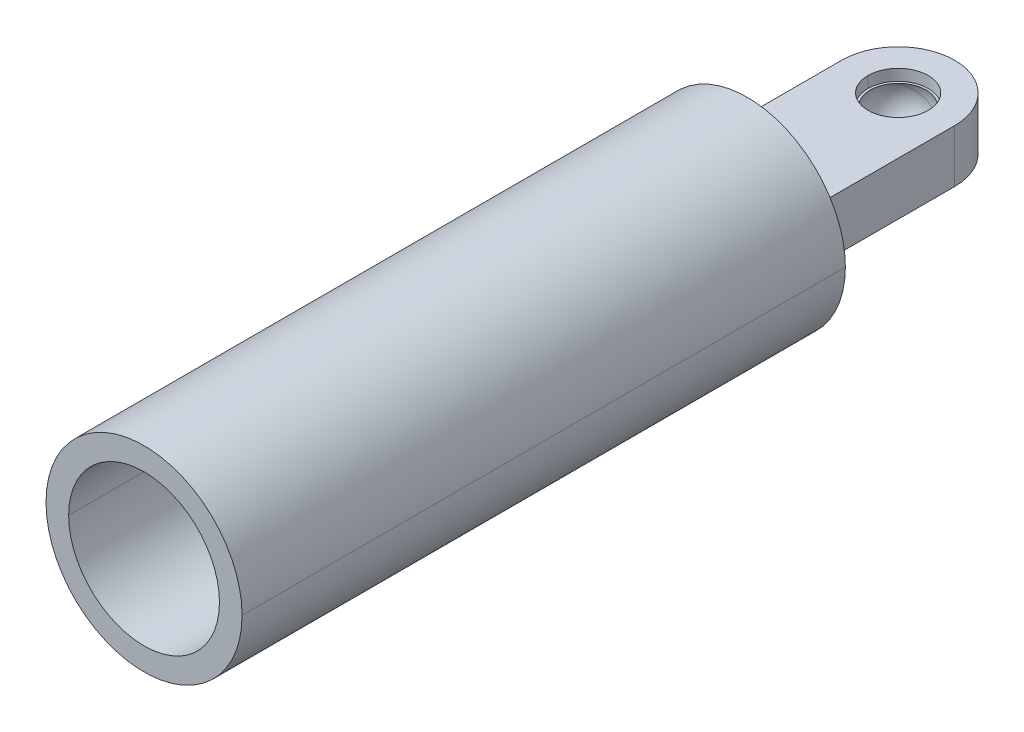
ISO-10303-21;
HEADER;
FILE_DESCRIPTION(('STEP AP214'),'2;1');
FILE_NAME('part.step','',(''),(''),'','','');
FILE_SCHEMA(('AUTOMOTIVE_DESIGN { 1 0 10303 214 1 1 1 1 }'));
ENDSEC;
DATA;
#1=APPLICATION_CONTEXT('core data for automotive mechanical design processes');
#2=APPLICATION_PROTOCOL_DEFINITION('international standard','automotive_design',2000,#1);
#3=PRODUCT_CONTEXT('',#1,'mechanical');
#4=PRODUCT('Part','Part','',(#3));
#5=PRODUCT_RELATED_PRODUCT_CATEGORY('part','',(#4));
#6=PRODUCT_DEFINITION_FORMATION('','',#4);
#7=PRODUCT_DEFINITION_CONTEXT('part definition',#1,'design');
#8=PRODUCT_DEFINITION('design','',#6,#7);
#9=PRODUCT_DEFINITION_SHAPE('','',#8);
#10=(LENGTH_UNIT() NAMED_UNIT(*) SI_UNIT(.MILLI.,.METRE.));
#11=(NAMED_UNIT(*) PLANE_ANGLE_UNIT() SI_UNIT($,.RADIAN.));
#12=(NAMED_UNIT(*) SI_UNIT($,.STERADIAN.) SOLID_ANGLE_UNIT());
#13=UNCERTAINTY_MEASURE_WITH_UNIT(LENGTH_MEASURE(1.E-05),#10,'distance_accuracy_value','');
#14=(GEOMETRIC_REPRESENTATION_CONTEXT(3) GLOBAL_UNCERTAINTY_ASSIGNED_CONTEXT((#13)) GLOBAL_UNIT_ASSIGNED_CONTEXT((#10,
#11,#12)) REPRESENTATION_CONTEXT('',''));
#15=CARTESIAN_POINT('',(0.,0.,0.));
#16=DIRECTION('',(0.,0.,1.));
#17=DIRECTION('',(1.,0.,0.));
#18=AXIS2_PLACEMENT_3D('',#15,#16,#17);
#19=CARTESIAN_POINT('',(0.,0.,160.));
#20=DIRECTION('',(0.,0.,1.));
#21=DIRECTION('',(1.,0.,0.));
#22=AXIS2_PLACEMENT_3D('',#19,#20,#21);
#23=PLANE('',#22);
#24=CARTESIAN_POINT('',(0.,0.,160.));
#25=DIRECTION('',(0.,0.,1.));
#26=DIRECTION('',(1.,0.,0.));
#27=AXIS2_PLACEMENT_3D('',#24,#25,#26);
#28=CIRCLE('',#27,20.);
#29=CARTESIAN_POINT('',(-20.,0.,160.));
#30=VERTEX_POINT('',#29);
#31=CARTESIAN_POINT('',(20.,0.,160.));
#32=VERTEX_POINT('',#31);
#33=EDGE_CURVE('E172',#30,#32,#28,.T.);
#34=ORIENTED_EDGE('',*,*,#33,.F.);
#35=CARTESIAN_POINT('',(0.,0.,160.));
#36=DIRECTION('',(0.,0.,1.));
#37=DIRECTION('',(1.,0.,0.));
#38=AXIS2_PLACEMENT_3D('',#35,#36,#37);
#39=CIRCLE('',#38,20.);
#40=EDGE_CURVE('E229',#32,#30,#39,.T.);
#41=ORIENTED_EDGE('',*,*,#40,.F.);
#42=EDGE_LOOP('',(#34,#41));
#43=FACE_BOUND('',#42,.T.);
#44=CARTESIAN_POINT('',(0.,0.,160.));
#45=DIRECTION('',(0.,0.,1.));
#46=DIRECTION('',(1.,0.,0.));
#47=AXIS2_PLACEMENT_3D('',#44,#45,#46);
#48=CIRCLE('',#47,26.);
#49=CARTESIAN_POINT('',(26.,0.,160.));
#50=VERTEX_POINT('',#49);
#51=CARTESIAN_POINT('',(-26.,0.,160.));
#52=VERTEX_POINT('',#51);
#53=EDGE_CURVE('E27',#50,#52,#48,.T.);
#54=ORIENTED_EDGE('',*,*,#53,.T.);
#55=CARTESIAN_POINT('',(0.,0.,160.));
#56=DIRECTION('',(0.,0.,1.));
#57=DIRECTION('',(1.,0.,0.));
#58=AXIS2_PLACEMENT_3D('',#55,#56,#57);
#59=CIRCLE('',#58,26.);
#60=EDGE_CURVE('E11',#52,#50,#59,.T.);
#61=ORIENTED_EDGE('',*,*,#60,.T.);
#62=EDGE_LOOP('',(#54,#61));
#63=FACE_BOUND('',#62,.T.);
#64=ADVANCED_FACE('F16',(#43,#63),#23,.T.);
#65=CARTESIAN_POINT('',(0.,0.,125.));
#66=DIRECTION('',(0.,0.,-1.));
#67=DIRECTION('',(1.,0.,0.));
#68=AXIS2_PLACEMENT_3D('',#65,#66,#67);
#69=CYLINDRICAL_SURFACE('',#68,26.);
#70=DIRECTION('',(0.,0.,1.));
#71=VECTOR('',#70,1.);
#72=CARTESIAN_POINT('',(-26.,0.,125.));
#73=LINE('',#72,#71);
#74=CARTESIAN_POINT('',(-26.,0.,0.));
#75=VERTEX_POINT('',#74);
#76=EDGE_CURVE('E138',#75,#52,#73,.T.);
#77=ORIENTED_EDGE('',*,*,#76,.F.);
#78=CARTESIAN_POINT('',(0.,0.,0.));
#79=DIRECTION('',(0.,0.,1.));
#80=DIRECTION('',(1.,0.,0.));
#81=AXIS2_PLACEMENT_3D('',#78,#79,#80);
#82=CIRCLE('',#81,26.);
#83=CARTESIAN_POINT('',(26.,0.,0.));
#84=VERTEX_POINT('',#83);
#85=EDGE_CURVE('E142',#75,#84,#82,.T.);
#86=ORIENTED_EDGE('',*,*,#85,.T.);
#87=DIRECTION('',(0.,0.,1.));
#88=VECTOR('',#87,1.);
#89=CARTESIAN_POINT('',(26.,0.,125.));
#90=LINE('',#89,#88);
#91=EDGE_CURVE('E146',#84,#50,#90,.T.);
#92=ORIENTED_EDGE('',*,*,#91,.T.);
#93=ORIENTED_EDGE('',*,*,#60,.F.);
#94=EDGE_LOOP('',(#77,#86,#92,#93));
#95=FACE_BOUND('',#94,.T.);
#96=ADVANCED_FACE('F140',(#95),#69,.T.);
#97=CARTESIAN_POINT('',(0.,0.,125.));
#98=DIRECTION('',(0.,0.,-1.));
#99=DIRECTION('',(1.,0.,0.));
#100=AXIS2_PLACEMENT_3D('',#97,#98,#99);
#101=CYLINDRICAL_SURFACE('',#100,26.);
#102=ORIENTED_EDGE('',*,*,#91,.F.);
#103=CARTESIAN_POINT('',(0.,0.,0.));
#104=DIRECTION('',(0.,0.,1.));
#105=DIRECTION('',(1.,0.,0.));
#106=AXIS2_PLACEMENT_3D('',#103,#104,#105);
#107=CIRCLE('',#106,26.);
#108=EDGE_CURVE('E149',#84,#75,#107,.T.);
#109=ORIENTED_EDGE('',*,*,#108,.T.);
#110=ORIENTED_EDGE('',*,*,#76,.T.);
#111=ORIENTED_EDGE('',*,*,#53,.F.);
#112=EDGE_LOOP('',(#102,#109,#110,#111));
#113=FACE_BOUND('',#112,.T.);
#114=ADVANCED_FACE('F18',(#113),#101,.T.);
#115=CARTESIAN_POINT('',(0.,0.,135.));
#116=DIRECTION('',(0.,0.,-1.));
#117=DIRECTION('',(1.,0.,0.));
#118=AXIS2_PLACEMENT_3D('',#115,#116,#117);
#119=CYLINDRICAL_SURFACE('',#118,20.);
#120=ORIENTED_EDGE('',*,*,#40,.T.);
#121=DIRECTION('',(0.,0.,-1.));
#122=VECTOR('',#121,1.);
#123=CARTESIAN_POINT('',(-20.,0.,135.));
#124=LINE('',#123,#122);
#125=CARTESIAN_POINT('',(-20.,0.,20.));
#126=VERTEX_POINT('',#125);
#127=EDGE_CURVE('E171',#30,#126,#124,.T.);
#128=ORIENTED_EDGE('',*,*,#127,.T.);
#129=CARTESIAN_POINT('',(0.,0.,20.));
#130=DIRECTION('',(0.,0.,1.));
#131=DIRECTION('',(1.,0.,0.));
#132=AXIS2_PLACEMENT_3D('',#129,#130,#131);
#133=CIRCLE('',#132,20.);
#134=CARTESIAN_POINT('',(20.,0.,20.));
#135=VERTEX_POINT('',#134);
#136=EDGE_CURVE('E182',#135,#126,#133,.T.);
#137=ORIENTED_EDGE('',*,*,#136,.F.);
#138=DIRECTION('',(0.,0.,-1.));
#139=VECTOR('',#138,1.);
#140=CARTESIAN_POINT('',(20.,0.,135.));
#141=LINE('',#140,#139);
#142=EDGE_CURVE('E169',#32,#135,#141,.T.);
#143=ORIENTED_EDGE('',*,*,#142,.F.);
#144=EDGE_LOOP('',(#120,#128,#137,#143));
#145=FACE_BOUND('',#144,.T.);
#146=ADVANCED_FACE('F352',(#145),#119,.F.);
#147=CARTESIAN_POINT('',(0.,0.,135.));
#148=DIRECTION('',(0.,0.,-1.));
#149=DIRECTION('',(1.,0.,0.));
#150=AXIS2_PLACEMENT_3D('',#147,#148,#149);
#151=CYLINDRICAL_SURFACE('',#150,20.);
#152=ORIENTED_EDGE('',*,*,#33,.T.);
#153=ORIENTED_EDGE('',*,*,#142,.T.);
#154=CARTESIAN_POINT('',(0.,0.,20.));
#155=DIRECTION('',(0.,0.,1.));
#156=DIRECTION('',(1.,0.,0.));
#157=AXIS2_PLACEMENT_3D('',#154,#155,#156);
#158=CIRCLE('',#157,20.);
#159=EDGE_CURVE('E262',#126,#135,#158,.T.);
#160=ORIENTED_EDGE('',*,*,#159,.F.);
#161=ORIENTED_EDGE('',*,*,#127,.F.);
#162=EDGE_LOOP('',(#152,#153,#160,#161));
#163=FACE_BOUND('',#162,.T.);
#164=ADVANCED_FACE('F343',(#163),#151,.F.);
#165=CARTESIAN_POINT('',(0.,4.,0.));
#166=DIRECTION('',(0.,1.,0.));
#167=DIRECTION('',(-1.,0.,0.));
#168=AXIS2_PLACEMENT_3D('',#165,#166,#167);
#169=PLANE('',#168);
#170=CARTESIAN_POINT('',(-5.67268144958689,4.,-35.2865210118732));
#171=CARTESIAN_POINT('',(-5.48124132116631,4.,-35.0561224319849));
#172=CARTESIAN_POINT('',(-5.27897665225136,4.,-34.8364933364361));
#173=CARTESIAN_POINT('',(-5.06705131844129,4.,-34.6286179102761));
#174=CARTESIAN_POINT('',(-4.64681073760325,4.,-34.255908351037));
#175=CARTESIAN_POINT('',(-4.20635765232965,4.,-33.933413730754));
#176=CARTESIAN_POINT('',(-3.99344011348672,4.,-33.7916364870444));
#177=CARTESIAN_POINT('',(-3.53090906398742,4.,-33.5113750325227));
#178=CARTESIAN_POINT('',(-3.07619339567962,4.,-33.2886833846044));
#179=CARTESIAN_POINT('',(-2.8373642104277,4.,-33.1853028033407));
#180=CARTESIAN_POINT('',(-2.30941941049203,4.,-32.9823868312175));
#181=CARTESIAN_POINT('',(-1.82807388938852,4.,-32.8469219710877));
#182=CARTESIAN_POINT('',(-1.57262529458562,4.,-32.7877505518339));
#183=CARTESIAN_POINT('',(-1.18677991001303,4.,-32.7145680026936));
#184=CARTESIAN_POINT('',(-0.825931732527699,4.,-32.6691697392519));
#185=CARTESIAN_POINT('',(-0.69411470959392,4.,-32.6556143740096));
#186=CARTESIAN_POINT('',(-0.305071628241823,4.,-32.6241582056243));
#187=CARTESIAN_POINT('',(0.0712526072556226,4.,-32.6186834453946));
#188=CARTESIAN_POINT('',(0.322025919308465,4.,-32.6251929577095));
#189=CARTESIAN_POINT('',(0.771698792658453,4.,-32.655422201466));
#190=CARTESIAN_POINT('',(1.25485346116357,4.,-32.727495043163));
#191=CARTESIAN_POINT('',(1.47182276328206,4.,-32.767591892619));
#192=CARTESIAN_POINT('',(1.87993425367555,4.,-32.8593824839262));
#193=CARTESIAN_POINT('',(2.32650211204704,4.,-32.9964782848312));
#194=CARTESIAN_POINT('',(2.53174491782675,4.,-33.0673196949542));
#195=CARTESIAN_POINT('',(2.9781232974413,4.,-33.2410543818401));
#196=CARTESIAN_POINT('',(3.44925372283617,4.,-33.471974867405));
#197=CARTESIAN_POINT('',(3.69995954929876,4.,-33.6097591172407));
#198=CARTESIAN_POINT('',(4.10292046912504,4.,-33.8587245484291));
#199=CARTESIAN_POINT('',(4.4979798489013,4.,-34.1505514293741));
#200=CARTESIAN_POINT('',(4.6447648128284,4.,-34.2662917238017));
#201=CARTESIAN_POINT('',(4.94127993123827,4.,-34.5159184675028));
#202=CARTESIAN_POINT('',(5.22477903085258,4.,-34.7885362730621));
#203=CARTESIAN_POINT('',(5.36630311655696,4.,-34.934307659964));
#204=CARTESIAN_POINT('',(5.80759600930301,4.,-35.4215174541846));
#205=CARTESIAN_POINT('',(6.19711926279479,4.,-35.9615424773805));
#206=CARTESIAN_POINT('',(6.43683026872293,4.,-36.3555947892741));
#207=CARTESIAN_POINT('',(6.87288364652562,4.,-37.2174911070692));
#208=CARTESIAN_POINT('',(7.1639549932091,4.,-38.1407036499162));
#209=CARTESIAN_POINT('',(7.27433878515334,4.,-38.6350591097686));
#210=CARTESIAN_POINT('',(7.41107399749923,4.,-39.6487659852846));
#211=CARTESIAN_POINT('',(7.37197403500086,4.,-40.671073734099));
#212=CARTESIAN_POINT('',(7.30702266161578,4.,-41.1848627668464));
#213=CARTESIAN_POINT('',(7.09042080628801,4.,-42.1846745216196));
#214=CARTESIAN_POINT('',(6.70599501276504,4.,-43.1317681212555));
#215=CARTESIAN_POINT('',(6.47637908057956,4.,-43.5825205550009));
#216=CARTESIAN_POINT('',(6.04388747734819,4.,-44.2769014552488));
#217=CARTESIAN_POINT('',(5.52635389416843,4.,-44.8989535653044));
#218=CARTESIAN_POINT('',(5.31634659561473,4.,-45.1258811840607));
#219=CARTESIAN_POINT('',(4.89803331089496,4.,-45.5329138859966));
#220=CARTESIAN_POINT('',(4.45253855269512,4.,-45.8889831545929));
#221=CARTESIAN_POINT('',(4.2366204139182,4.,-46.0457669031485));
#222=CARTESIAN_POINT('',(3.76836988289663,4.,-46.3547696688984));
#223=CARTESIAN_POINT('',(3.30122781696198,4.,-46.6041958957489));
#224=CARTESIAN_POINT('',(3.05594409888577,4.,-46.7201720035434));
#225=CARTESIAN_POINT('',(2.51990808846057,4.,-46.9455356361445));
#226=CARTESIAN_POINT('',(2.02699847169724,4.,-47.099602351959));
#227=CARTESIAN_POINT('',(1.76858842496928,4.,-47.166936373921));
#228=CARTESIAN_POINT('',(1.3816841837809,4.,-47.2510405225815));
#229=CARTESIAN_POINT('',(1.02190926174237,4.,-47.3060426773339));
#230=CARTESIAN_POINT('',(0.892469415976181,4.,-47.3228685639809));
#231=CARTESIAN_POINT('',(0.508520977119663,4.,-47.3644451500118));
#232=CARTESIAN_POINT('',(0.141961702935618,4.,-47.3799869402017));
#233=CARTESIAN_POINT('',(-0.100744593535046,4.,-47.3806478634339));
#234=CARTESIAN_POINT('',(-0.545242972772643,4.,-47.3642569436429));
#235=CARTESIAN_POINT('',(-1.01372412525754,4.,-47.3100561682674));
#236=CARTESIAN_POINT('',(-1.2319261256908,4.,-47.2770718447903));
#237=CARTESIAN_POINT('',(-1.6418586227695,4.,-47.19903554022));
#238=CARTESIAN_POINT('',(-2.09142937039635,4.,-47.0772665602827));
#239=CARTESIAN_POINT('',(-2.29914818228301,4.,-47.0132807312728));
#240=CARTESIAN_POINT('',(-2.69989030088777,4.,-46.8725919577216));
#241=CARTESIAN_POINT('',(-3.12547697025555,4.,-46.6856428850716));
#242=CARTESIAN_POINT('',(-3.32539309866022,4.,-46.5890412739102));
#243=CARTESIAN_POINT('',(-3.67589063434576,4.,-46.4023430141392));
#244=CARTESIAN_POINT('',(-4.02819846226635,4.,-46.1819491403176));
#245=CARTESIAN_POINT('',(-4.17643455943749,4.,-46.0829395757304));
#246=CARTESIAN_POINT('',(-4.5856014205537,4.,-45.7910646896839));
#247=CARTESIAN_POINT('',(-4.98052931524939,4.,-45.4550799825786));
#248=CARTESIAN_POINT('',(-5.2240890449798,4.,-45.2226947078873));
#249=CARTESIAN_POINT('',(-5.45535984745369,4.,-44.9750259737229));
#250=CARTESIAN_POINT('',(-5.67268144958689,4.,-44.7134789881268));
#251=(BOUNDED_CURVE() B_SPLINE_CURVE(5,(#170,#171,#172,#173,#174,#175,#176,#177,#178,#179,#180,
#181,#182,#183,#184,#185,#186,#187,#188,#189,#190,#191,#192,#193,#194,#195,#196,#197,#198,#199,
#200,#201,#202,#203,#204,#205,#206,#207,#208,#209,#210,#211,#212,#213,#214,#215,#216,#217,#218,
#219,#220,#221,#222,#223,#224,#225,#226,#227,#228,#229,#230,#231,#232,#233,#234,#235,#236,#237,
#238,#239,#240,#241,#242,#243,#244,#245,#246,#247,#248,#249,#250),.UNSPECIFIED.,.F.,
.F.) B_SPLINE_CURVE_WITH_KNOTS((6,3,3,3,3,3,3,3,3,3,3,3,3,3,3,3,3,3,3,3,3,3,3,3,3,3,6),(0.,
2.14443905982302,4.10076829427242,6.3837320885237,9.32306877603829,11.0719752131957,
14.5690121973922,17.2147246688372,19.3094610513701,21.6102182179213,22.9981479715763,
24.4633685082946,27.7200288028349,31.2838145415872,34.9266974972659,38.4897218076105,
40.7079117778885,42.7121589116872,45.0116689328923,47.8839058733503,49.5594241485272,
52.9528200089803,55.7188096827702,57.9159585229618,59.7866656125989,61.1523891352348,
63.5867425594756),
.UNSPECIFIED.) CURVE() GEOMETRIC_REPRESENTATION_ITEM() RATIONAL_B_SPLINE_CURVE((1.,1.,1.,1.,1.,
1.,1.,1.,1.,1.,1.,1.,1.,1.,1.,1.,1.,1.,1.,1.,1.,1.,1.,1.,1.,1.,1.,1.,1.,1.,1.,1.,1.,1.,1.,1.,1.,
1.,1.,1.,1.,1.,1.,1.,1.,1.,1.,1.,1.,1.,1.,1.,1.,1.,1.,1.,1.,1.,1.,1.,1.,1.,1.,1.,1.,1.,1.,1.,1.,
1.,1.,1.,1.,1.,1.,1.,1.,1.,1.,1.,1.)) REPRESENTATION_ITEM(''));
#252=CARTESIAN_POINT('',(-5.67268144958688,4.,-35.2865210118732));
#253=VERTEX_POINT('',#252);
#254=CARTESIAN_POINT('',(-5.67268144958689,4.,-44.7134789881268));
#255=VERTEX_POINT('',#254);
#256=EDGE_CURVE('E193',#253,#255,#251,.T.);
#257=ORIENTED_EDGE('',*,*,#256,.F.);
#258=CARTESIAN_POINT('',(-5.67268144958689,4.,-35.2865210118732));
#259=CARTESIAN_POINT('',(-5.96883285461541,4.,-35.642939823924));
#260=CARTESIAN_POINT('',(-6.23907960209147,4.,-36.0251307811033));
#261=CARTESIAN_POINT('',(-6.47898085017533,4.,-36.4293616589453));
#262=CARTESIAN_POINT('',(-6.90873002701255,4.,-37.3055563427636));
#263=CARTESIAN_POINT('',(-7.18962199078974,4.,-38.2420975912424));
#264=CARTESIAN_POINT('',(-7.29319623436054,4.,-38.7390446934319));
#265=CARTESIAN_POINT('',(-7.41546056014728,4.,-39.7556929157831));
#266=CARTESIAN_POINT('',(-7.36141478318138,4.,-40.778389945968));
#267=CARTESIAN_POINT('',(-7.2889886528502,4.,-41.2911677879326));
#268=CARTESIAN_POINT('',(-7.04507883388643,4.,-42.3427466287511));
#269=CARTESIAN_POINT('',(-6.61523541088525,4.,-43.3327923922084));
#270=CARTESIAN_POINT('',(-6.34298040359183,4.,-43.8255799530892));
#271=CARTESIAN_POINT('',(-6.02629739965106,4.,-44.28790148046));
#272=CARTESIAN_POINT('',(-5.67268144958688,4.,-44.7134789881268));
#273=(BOUNDED_CURVE() B_SPLINE_CURVE(5,(#258,#259,#260,#261,#262,#263,#264,#265,#266,#267,#268,
#269,#270,#271,#272),.UNSPECIFIED.,.F.,.F.) B_SPLINE_CURVE_WITH_KNOTS((6,3,3,3,6),(0.,
3.31737471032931,6.88879542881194,10.5315795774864,14.4926501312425),
.UNSPECIFIED.) CURVE() GEOMETRIC_REPRESENTATION_ITEM() RATIONAL_B_SPLINE_CURVE((1.,1.,1.,1.,1.,
1.,1.,1.,1.,1.,1.,1.,1.,1.,1.)) REPRESENTATION_ITEM(''));
#274=EDGE_CURVE('E315',#253,#255,#273,.T.);
#275=ORIENTED_EDGE('',*,*,#274,.T.);
#276=EDGE_LOOP('',(#257,#275));
#277=FACE_BOUND('',#276,.T.);
#278=CARTESIAN_POINT('',(0.,4.,-40.));
#279=DIRECTION('',(0.,1.,0.));
#280=DIRECTION('',(-1.,0.,0.));
#281=AXIS2_PLACEMENT_3D('',#278,#279,#280);
#282=CIRCLE('',#281,8.);
#283=CARTESIAN_POINT('',(-8.,4.,-40.));
#284=VERTEX_POINT('',#283);
#285=CARTESIAN_POINT('',(8.,4.,-40.));
#286=VERTEX_POINT('',#285);
#287=EDGE_CURVE('E176',#284,#286,#282,.T.);
#288=ORIENTED_EDGE('',*,*,#287,.T.);
#289=CARTESIAN_POINT('',(0.,4.,-40.));
#290=DIRECTION('',(0.,1.,0.));
#291=DIRECTION('',(-1.,0.,0.));
#292=AXIS2_PLACEMENT_3D('',#289,#290,#291);
#293=CIRCLE('',#292,8.);
#294=EDGE_CURVE('E204',#286,#284,#293,.T.);
#295=ORIENTED_EDGE('',*,*,#294,.T.);
#296=EDGE_LOOP('',(#288,#295));
#297=FACE_BOUND('',#296,.T.);
#298=ADVANCED_FACE('F337',(#277,#297),#169,.T.);
#299=CARTESIAN_POINT('',(0.,5.5,-40.));
#300=DIRECTION('',(0.,-1.,0.));
#301=DIRECTION('',(-1.,0.,0.));
#302=AXIS2_PLACEMENT_3D('',#299,#300,#301);
#303=CYLINDRICAL_SURFACE('',#302,8.);
#304=DIRECTION('',(0.,-1.,0.));
#305=VECTOR('',#304,1.);
#306=CARTESIAN_POINT('',(8.,5.5,-40.));
#307=LINE('',#306,#305);
#308=CARTESIAN_POINT('',(8.,7.,-40.));
#309=VERTEX_POINT('',#308);
#310=EDGE_CURVE('E173',#309,#286,#307,.T.);
#311=ORIENTED_EDGE('',*,*,#310,.F.);
#312=CARTESIAN_POINT('',(0.,7.,-40.));
#313=DIRECTION('',(0.,1.,0.));
#314=DIRECTION('',(-1.,0.,0.));
#315=AXIS2_PLACEMENT_3D('',#312,#313,#314);
#316=CIRCLE('',#315,8.);
#317=CARTESIAN_POINT('',(-8.,7.,-40.));
#318=VERTEX_POINT('',#317);
#319=EDGE_CURVE('E233',#309,#318,#316,.T.);
#320=ORIENTED_EDGE('',*,*,#319,.T.);
#321=DIRECTION('',(0.,-1.,0.));
#322=VECTOR('',#321,1.);
#323=CARTESIAN_POINT('',(-8.,5.5,-40.));
#324=LINE('',#323,#322);
#325=EDGE_CURVE('E177',#318,#284,#324,.T.);
#326=ORIENTED_EDGE('',*,*,#325,.T.);
#327=ORIENTED_EDGE('',*,*,#294,.F.);
#328=EDGE_LOOP('',(#311,#320,#326,#327));
#329=FACE_BOUND('',#328,.T.);
#330=ADVANCED_FACE('F330',(#329),#303,.F.);
#331=CARTESIAN_POINT('',(0.,5.5,-40.));
#332=DIRECTION('',(0.,-1.,0.));
#333=DIRECTION('',(-1.,0.,0.));
#334=AXIS2_PLACEMENT_3D('',#331,#332,#333);
#335=CYLINDRICAL_SURFACE('',#334,8.);
#336=ORIENTED_EDGE('',*,*,#325,.F.);
#337=CARTESIAN_POINT('',(0.,7.,-40.));
#338=DIRECTION('',(0.,1.,0.));
#339=DIRECTION('',(-1.,0.,0.));
#340=AXIS2_PLACEMENT_3D('',#337,#338,#339);
#341=CIRCLE('',#340,8.);
#342=EDGE_CURVE('E198',#318,#309,#341,.T.);
#343=ORIENTED_EDGE('',*,*,#342,.T.);
#344=ORIENTED_EDGE('',*,*,#310,.T.);
#345=ORIENTED_EDGE('',*,*,#287,.F.);
#346=EDGE_LOOP('',(#336,#343,#344,#345));
#347=FACE_BOUND('',#346,.T.);
#348=ADVANCED_FACE('F335',(#347),#335,.F.);
#349=CARTESIAN_POINT('',(0.,7.,0.));
#350=DIRECTION('',(0.,1.,0.));
#351=DIRECTION('',(-1.,0.,0.));
#352=AXIS2_PLACEMENT_3D('',#349,#350,#351);
#353=PLANE('',#352);
#354=ORIENTED_EDGE('',*,*,#342,.F.);
#355=ORIENTED_EDGE('',*,*,#319,.F.);
#356=EDGE_LOOP('',(#354,#355));
#357=FACE_BOUND('',#356,.T.);
#358=DIRECTION('',(0.,0.,-1.));
#359=VECTOR('',#358,1.);
#360=CARTESIAN_POINT('',(15.,7.,-20.));
#361=LINE('',#360,#359);
#362=CARTESIAN_POINT('',(15.,7.,0.));
#363=VERTEX_POINT('',#362);
#364=CARTESIAN_POINT('',(15.,7.,-40.));
#365=VERTEX_POINT('',#364);
#366=EDGE_CURVE('E239',#363,#365,#361,.T.);
#367=ORIENTED_EDGE('',*,*,#366,.T.);
#368=CARTESIAN_POINT('',(0.,7.,-40.));
#369=DIRECTION('',(0.,1.,0.));
#370=DIRECTION('',(-1.,0.,0.));
#371=AXIS2_PLACEMENT_3D('',#368,#369,#370);
#372=CIRCLE('',#371,15.);
#373=CARTESIAN_POINT('',(-15.,7.,-40.));
#374=VERTEX_POINT('',#373);
#375=EDGE_CURVE('E243',#365,#374,#372,.T.);
#376=ORIENTED_EDGE('',*,*,#375,.T.);
#377=DIRECTION('',(0.,0.,1.));
#378=VECTOR('',#377,1.);
#379=CARTESIAN_POINT('',(-15.,7.,-20.));
#380=LINE('',#379,#378);
#381=CARTESIAN_POINT('',(-15.,7.,0.));
#382=VERTEX_POINT('',#381);
#383=EDGE_CURVE('E158',#374,#382,#380,.T.);
#384=ORIENTED_EDGE('',*,*,#383,.T.);
#385=DIRECTION('',(1.,0.,0.));
#386=VECTOR('',#385,1.);
#387=CARTESIAN_POINT('',(0.,7.,0.));
#388=LINE('',#387,#386);
#389=EDGE_CURVE('E179',#382,#363,#388,.T.);
#390=ORIENTED_EDGE('',*,*,#389,.T.);
#391=EDGE_LOOP('',(#367,#376,#384,#390));
#392=FACE_BOUND('',#391,.T.);
#393=ADVANCED_FACE('F288',(#357,#392),#353,.T.);
#394=CARTESIAN_POINT('',(0.,0.901,-40.));
#395=DIRECTION('',(0.,0.,-1.));
#396=DIRECTION('',(1.,0.,0.));
#397=AXIS2_PLACEMENT_3D('',#394,#395,#396);
#398=SPHERICAL_SURFACE('',#397,8.);
#399=ORIENTED_EDGE('',*,*,#256,.T.);
#400=CARTESIAN_POINT('',(0.,0.901,-40.));
#401=DIRECTION('',(0.479425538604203,0.877582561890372,0.));
#402=DIRECTION('',(-0.877582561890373,0.479425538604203,0.));
#403=AXIS2_PLACEMENT_3D('',#400,#401,#402);
#404=CIRCLE('',#403,8.);
#405=CARTESIAN_POINT('',(0.,0.901,-48.));
#406=VERTEX_POINT('',#405);
#407=EDGE_CURVE('E189',#406,#255,#404,.T.);
#408=ORIENTED_EDGE('',*,*,#407,.F.);
#409=CARTESIAN_POINT('',(0.,0.901,-40.));
#410=DIRECTION('',(-0.479425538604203,-0.877582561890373,0.));
#411=DIRECTION('',(0.877582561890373,-0.479425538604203,0.));
#412=AXIS2_PLACEMENT_3D('',#409,#410,#411);
#413=CIRCLE('',#412,8.);
#414=CARTESIAN_POINT('',(0.,0.901,-32.));
#415=VERTEX_POINT('',#414);
#416=EDGE_CURVE('E194',#406,#415,#413,.T.);
#417=ORIENTED_EDGE('',*,*,#416,.T.);
#418=CARTESIAN_POINT('',(0.,0.901,-40.));
#419=DIRECTION('',(0.479425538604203,0.877582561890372,0.));
#420=DIRECTION('',(-0.877582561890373,0.479425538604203,0.));
#421=AXIS2_PLACEMENT_3D('',#418,#419,#420);
#422=CIRCLE('',#421,8.);
#423=EDGE_CURVE('E20',#253,#415,#422,.T.);
#424=ORIENTED_EDGE('',*,*,#423,.F.);
#425=EDGE_LOOP('',(#399,#408,#417,#424));
#426=FACE_BOUND('',#425,.T.);
#427=ADVANCED_FACE('F372',(#426),#398,.F.);
#428=CARTESIAN_POINT('',(0.,0.901,-40.));
#429=DIRECTION('',(0.,0.,-1.));
#430=DIRECTION('',(1.,0.,0.));
#431=AXIS2_PLACEMENT_3D('',#428,#429,#430);
#432=SPHERICAL_SURFACE('',#431,8.);
#433=CARTESIAN_POINT('',(-1.25466971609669,-7.,-39.999679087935));
#434=CARTESIAN_POINT('',(-1.25469312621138,-7.,-40.0972670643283));
#435=CARTESIAN_POINT('',(-1.24522788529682,-7.,-40.1948676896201));
#436=CARTESIAN_POINT('',(-1.22627340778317,-7.,-40.291249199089));
#437=CARTESIAN_POINT('',(-1.16140303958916,-7.,-40.5072497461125));
#438=CARTESIAN_POINT('',(-1.05011064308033,-7.,-40.7041741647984));
#439=CARTESIAN_POINT('',(-0.973370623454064,-7.,-40.8069124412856));
#440=CARTESIAN_POINT('',(-0.795946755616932,-7.,-40.9904199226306));
#441=CARTESIAN_POINT('',(-0.578944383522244,-7.,-41.123914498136));
#442=CARTESIAN_POINT('',(-0.462749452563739,-7.,-41.1764951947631));
#443=CARTESIAN_POINT('',(-0.219687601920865,-7.,-41.2513785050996));
#444=CARTESIAN_POINT('',(0.0340875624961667,-7.,-41.2637930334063));
#445=CARTESIAN_POINT('',(0.161315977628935,-7.,-41.2539272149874));
#446=CARTESIAN_POINT('',(0.410516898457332,-7.,-41.2024289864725));
#447=CARTESIAN_POINT('',(0.639572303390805,-7.,-41.0905887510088));
#448=CARTESIAN_POINT('',(0.746556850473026,-7.,-41.0203788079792));
#449=CARTESIAN_POINT('',(0.940417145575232,-7.,-40.8545011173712));
#450=CARTESIAN_POINT('',(1.08719296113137,-7.,-40.6453855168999));
#451=CARTESIAN_POINT('',(1.14691595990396,-7.,-40.5320795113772));
#452=CARTESIAN_POINT('',(1.2122535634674,-7.,-40.3575243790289));
#453=CARTESIAN_POINT('',(1.24444205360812,-7.,-40.175107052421));
#454=CARTESIAN_POINT('',(1.25129146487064,-7.,-40.11648247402));
#455=CARTESIAN_POINT('',(1.25467087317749,-7.,-40.0582411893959));
#456=CARTESIAN_POINT('',(1.25467087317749,-7.,-40.));
#457=(BOUNDED_CURVE() B_SPLINE_CURVE(5,(#433,#434,#435,#436,#437,#438,#439,#440,#441,#442,#443,
#444,#445,#446,#447,#448,#449,#450,#451,#452,#453,#454,#455,#456),.UNSPECIFIED.,.F.,
.F.) B_SPLINE_CURVE_WITH_KNOTS((6,3,3,3,3,3,3,6),(5.58650568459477,6.27649489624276,
7.17377900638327,8.06964457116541,8.96780571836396,9.8653954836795,10.7611839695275,
11.1730113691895),
.UNSPECIFIED.) CURVE() GEOMETRIC_REPRESENTATION_ITEM() RATIONAL_B_SPLINE_CURVE((1.,1.,1.,1.,1.,
1.,1.,1.,1.,1.,1.,1.,1.,1.,1.,1.,1.,1.,1.,1.,1.,1.,1.,1.)) REPRESENTATION_ITEM(''));
#458=CARTESIAN_POINT('',(-1.25466971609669,-7.,-39.999679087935));
#459=VERTEX_POINT('',#458);
#460=CARTESIAN_POINT('',(1.25467087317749,-7.,-40.));
#461=VERTEX_POINT('',#460);
#462=EDGE_CURVE('E224',#459,#461,#457,.T.);
#463=ORIENTED_EDGE('',*,*,#462,.T.);
#464=CARTESIAN_POINT('',(1.25467087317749,-7.,-40.));
#465=CARTESIAN_POINT('',(1.25467087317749,-7.,-39.8735956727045));
#466=CARTESIAN_POINT('',(1.23875230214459,-7.,-39.747191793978));
#467=CARTESIAN_POINT('',(1.20689591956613,-7.,-39.6234031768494));
#468=CARTESIAN_POINT('',(1.11257931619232,-7.,-39.3862676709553));
#469=CARTESIAN_POINT('',(0.962431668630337,-7.,-39.1800821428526));
#470=CARTESIAN_POINT('',(0.874536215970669,-7.,-39.0869435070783));
#471=CARTESIAN_POINT('',(0.677475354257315,-7.,-38.9251022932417));
#472=CARTESIAN_POINT('',(0.446915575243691,-7.,-38.8173774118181));
#473=CARTESIAN_POINT('',(0.325545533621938,-7.,-38.7784112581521));
#474=CARTESIAN_POINT('',(0.0756050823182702,-7.,-38.7317342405));
#475=CARTESIAN_POINT('',(-0.178026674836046,-7.,-38.7483352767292));
#476=CARTESIAN_POINT('',(-0.303398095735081,-7.,-38.7726624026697));
#477=CARTESIAN_POINT('',(-0.54522775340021,-7.,-38.8523316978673));
#478=CARTESIAN_POINT('',(-0.760164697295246,-7.,-38.9897513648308));
#479=CARTESIAN_POINT('',(-0.858433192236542,-7.,-39.0717663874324));
#480=CARTESIAN_POINT('',(-1.03211917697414,-7.,-39.2588437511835));
#481=CARTESIAN_POINT('',(-1.15398883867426,-7.,-39.4834273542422));
#482=CARTESIAN_POINT('',(-1.20034969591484,-7.,-39.6028843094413));
#483=CARTESIAN_POINT('',(-1.23826820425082,-7.,-39.7556707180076));
#484=CARTESIAN_POINT('',(-1.25205284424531,-7.,-39.911310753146));
#485=CARTESIAN_POINT('',(-1.25379035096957,-7.,-39.9407431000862));
#486=CARTESIAN_POINT('',(-1.25466264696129,-7.,-39.9702105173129));
#487=CARTESIAN_POINT('',(-1.25466971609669,-7.,-39.999679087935));
#488=(BOUNDED_CURVE() B_SPLINE_CURVE(5,(#464,#465,#466,#467,#468,#469,#470,#471,#472,#473,#474,
#475,#476,#477,#478,#479,#480,#481,#482,#483,#484,#485,#486,#487),.UNSPECIFIED.,.F.,
.F.) B_SPLINE_CURVE_WITH_KNOTS((6,3,3,3,3,3,3,6),(0.,0.89381357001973,1.79047969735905,
2.68668770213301,3.5851765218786,4.48213128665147,5.37815014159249,5.58650568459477),
.UNSPECIFIED.) CURVE() GEOMETRIC_REPRESENTATION_ITEM() RATIONAL_B_SPLINE_CURVE((1.,1.,1.,1.,1.,
1.,1.,1.,1.,1.,1.,1.,1.,1.,1.,1.,1.,1.,1.,1.,1.,1.,1.,1.)) REPRESENTATION_ITEM(''));
#489=EDGE_CURVE('E256',#461,#459,#488,.T.);
#490=ORIENTED_EDGE('',*,*,#489,.T.);
#491=EDGE_LOOP('',(#463,#490));
#492=FACE_BOUND('',#491,.T.);
#493=ORIENTED_EDGE('',*,*,#274,.F.);
#494=ORIENTED_EDGE('',*,*,#423,.T.);
#495=ORIENTED_EDGE('',*,*,#416,.F.);
#496=ORIENTED_EDGE('',*,*,#407,.T.);
#497=EDGE_LOOP('',(#493,#494,#495,#496));
#498=FACE_BOUND('',#497,.T.);
#499=ADVANCED_FACE('F368',(#492,#498),#432,.F.);
#500=CARTESIAN_POINT('',(0.,-7.,0.));
#501=DIRECTION('',(0.,1.,0.));
#502=DIRECTION('',(-1.,0.,0.));
#503=AXIS2_PLACEMENT_3D('',#500,#501,#502);
#504=PLANE('',#503);
#505=ORIENTED_EDGE('',*,*,#489,.F.);
#506=ORIENTED_EDGE('',*,*,#462,.F.);
#507=EDGE_LOOP('',(#505,#506));
#508=FACE_BOUND('',#507,.T.);
#509=DIRECTION('',(1.,0.,0.));
#510=VECTOR('',#509,1.);
#511=CARTESIAN_POINT('',(0.,-7.,0.));
#512=LINE('',#511,#510);
#513=CARTESIAN_POINT('',(-15.,-7.,0.));
#514=VERTEX_POINT('',#513);
#515=CARTESIAN_POINT('',(15.,-7.,0.));
#516=VERTEX_POINT('',#515);
#517=EDGE_CURVE('E153',#514,#516,#512,.T.);
#518=ORIENTED_EDGE('',*,*,#517,.F.);
#519=DIRECTION('',(0.,0.,1.));
#520=VECTOR('',#519,1.);
#521=CARTESIAN_POINT('',(-15.,-7.,-20.));
#522=LINE('',#521,#520);
#523=CARTESIAN_POINT('',(-15.,-7.,-40.));
#524=VERTEX_POINT('',#523);
#525=EDGE_CURVE('E247',#524,#514,#522,.T.);
#526=ORIENTED_EDGE('',*,*,#525,.F.);
#527=CARTESIAN_POINT('',(0.,-7.,-40.));
#528=DIRECTION('',(0.,1.,0.));
#529=DIRECTION('',(-1.,0.,0.));
#530=AXIS2_PLACEMENT_3D('',#527,#528,#529);
#531=CIRCLE('',#530,15.);
#532=CARTESIAN_POINT('',(15.,-7.,-40.));
#533=VERTEX_POINT('',#532);
#534=EDGE_CURVE('E234',#533,#524,#531,.T.);
#535=ORIENTED_EDGE('',*,*,#534,.F.);
#536=DIRECTION('',(0.,0.,-1.));
#537=VECTOR('',#536,1.);
#538=CARTESIAN_POINT('',(15.,-7.,-20.));
#539=LINE('',#538,#537);
#540=EDGE_CURVE('E183',#516,#533,#539,.T.);
#541=ORIENTED_EDGE('',*,*,#540,.F.);
#542=EDGE_LOOP('',(#518,#526,#535,#541));
#543=FACE_BOUND('',#542,.T.);
#544=ADVANCED_FACE('F371',(#508,#543),#504,.F.);
#545=CARTESIAN_POINT('',(0.,0.,20.));
#546=DIRECTION('',(0.,0.,1.));
#547=DIRECTION('',(1.,0.,0.));
#548=AXIS2_PLACEMENT_3D('',#545,#546,#547);
#549=PLANE('',#548);
#550=ORIENTED_EDGE('',*,*,#136,.T.);
#551=ORIENTED_EDGE('',*,*,#159,.T.);
#552=EDGE_LOOP('',(#550,#551));
#553=FACE_BOUND('',#552,.T.);
#554=ADVANCED_FACE('F376',(#553),#549,.T.);
#555=CARTESIAN_POINT('',(0.,0.,0.));
#556=DIRECTION('',(0.,0.,1.));
#557=DIRECTION('',(1.,0.,0.));
#558=AXIS2_PLACEMENT_3D('',#555,#556,#557);
#559=PLANE('',#558);
#560=ORIENTED_EDGE('',*,*,#517,.T.);
#561=DIRECTION('',(0.,1.,0.));
#562=VECTOR('',#561,1.);
#563=CARTESIAN_POINT('',(15.,0.,0.));
#564=LINE('',#563,#562);
#565=EDGE_CURVE('E188',#516,#363,#564,.T.);
#566=ORIENTED_EDGE('',*,*,#565,.T.);
#567=ORIENTED_EDGE('',*,*,#389,.F.);
#568=DIRECTION('',(0.,1.,0.));
#569=VECTOR('',#568,1.);
#570=CARTESIAN_POINT('',(-15.,0.,0.));
#571=LINE('',#570,#569);
#572=EDGE_CURVE('E165',#514,#382,#571,.T.);
#573=ORIENTED_EDGE('',*,*,#572,.F.);
#574=EDGE_LOOP('',(#560,#566,#567,#573));
#575=FACE_BOUND('',#574,.T.);
#576=ORIENTED_EDGE('',*,*,#85,.F.);
#577=ORIENTED_EDGE('',*,*,#108,.F.);
#578=EDGE_LOOP('',(#576,#577));
#579=FACE_BOUND('',#578,.T.);
#580=ADVANCED_FACE('F156',(#575,#579),#559,.F.);
#581=CARTESIAN_POINT('',(-15.,0.,-40.));
#582=DIRECTION('',(-1.,0.,0.));
#583=DIRECTION('',(0.,0.,1.));
#584=AXIS2_PLACEMENT_3D('',#581,#582,#583);
#585=PLANE('',#584);
#586=DIRECTION('',(0.,1.,0.));
#587=VECTOR('',#586,1.);
#588=CARTESIAN_POINT('',(-15.,0.,-40.));
#589=LINE('',#588,#587);
#590=EDGE_CURVE('E238',#524,#374,#589,.T.);
#591=ORIENTED_EDGE('',*,*,#590,.F.);
#592=ORIENTED_EDGE('',*,*,#525,.T.);
#593=ORIENTED_EDGE('',*,*,#572,.T.);
#594=ORIENTED_EDGE('',*,*,#383,.F.);
#595=EDGE_LOOP('',(#591,#592,#593,#594));
#596=FACE_BOUND('',#595,.T.);
#597=ADVANCED_FACE('F303',(#596),#585,.T.);
#598=CARTESIAN_POINT('',(0.,0.,-40.));
#599=DIRECTION('',(0.,-1.,0.));
#600=DIRECTION('',(-1.,0.,0.));
#601=AXIS2_PLACEMENT_3D('',#598,#599,#600);
#602=CYLINDRICAL_SURFACE('',#601,15.);
#603=DIRECTION('',(0.,1.,0.));
#604=VECTOR('',#603,1.);
#605=CARTESIAN_POINT('',(15.,0.,-40.));
#606=LINE('',#605,#604);
#607=EDGE_CURVE('E187',#533,#365,#606,.T.);
#608=ORIENTED_EDGE('',*,*,#607,.F.);
#609=ORIENTED_EDGE('',*,*,#534,.T.);
#610=ORIENTED_EDGE('',*,*,#590,.T.);
#611=ORIENTED_EDGE('',*,*,#375,.F.);
#612=EDGE_LOOP('',(#608,#609,#610,#611));
#613=FACE_BOUND('',#612,.T.);
#614=ADVANCED_FACE('F298',(#613),#602,.T.);
#615=CARTESIAN_POINT('',(15.,0.,0.));
#616=DIRECTION('',(1.,0.,0.));
#617=DIRECTION('',(0.,0.,-1.));
#618=AXIS2_PLACEMENT_3D('',#615,#616,#617);
#619=PLANE('',#618);
#620=ORIENTED_EDGE('',*,*,#565,.F.);
#621=ORIENTED_EDGE('',*,*,#540,.T.);
#622=ORIENTED_EDGE('',*,*,#607,.T.);
#623=ORIENTED_EDGE('',*,*,#366,.F.);
#624=EDGE_LOOP('',(#620,#621,#622,#623));
#625=FACE_BOUND('',#624,.T.);
#626=ADVANCED_FACE('F294',(#625),#619,.T.);
#627=CLOSED_SHELL('',(#64,#96,#114,#146,#164,#298,#330,#348,#393,#427,#499,#544,#554,#580,#597,
#614,#626));
#628=MANIFOLD_SOLID_BREP('B1',#627);
#629=ADVANCED_BREP_SHAPE_REPRESENTATION('',(#18,#628),#14);
#630=SHAPE_DEFINITION_REPRESENTATION(#9,#629);
ENDSEC;
END-ISO-10303-21;
